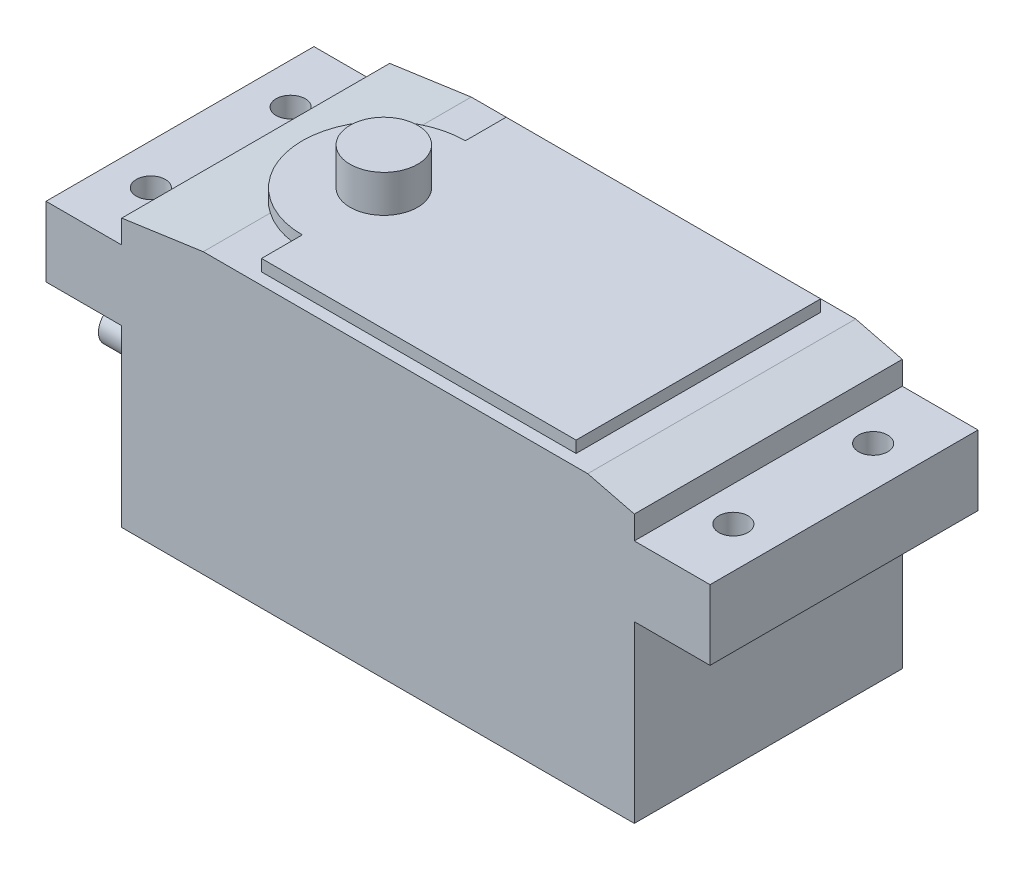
ISO-10303-21;
HEADER;
FILE_DESCRIPTION(('STEP AP214'),'2;1');
FILE_NAME('part.step','',(''),(''),'','','');
FILE_SCHEMA(('AUTOMOTIVE_DESIGN { 1 0 10303 214 1 1 1 1 }'));
ENDSEC;
DATA;
#1=APPLICATION_CONTEXT('core data for automotive mechanical design processes');
#2=APPLICATION_PROTOCOL_DEFINITION('international standard','automotive_design',2000,#1);
#3=PRODUCT_CONTEXT('',#1,'mechanical');
#4=PRODUCT('Part','Part','',(#3));
#5=PRODUCT_RELATED_PRODUCT_CATEGORY('part','',(#4));
#6=PRODUCT_DEFINITION_FORMATION('','',#4);
#7=PRODUCT_DEFINITION_CONTEXT('part definition',#1,'design');
#8=PRODUCT_DEFINITION('design','',#6,#7);
#9=PRODUCT_DEFINITION_SHAPE('','',#8);
#10=(LENGTH_UNIT() NAMED_UNIT(*) SI_UNIT(.MILLI.,.METRE.));
#11=(NAMED_UNIT(*) PLANE_ANGLE_UNIT() SI_UNIT($,.RADIAN.));
#12=(NAMED_UNIT(*) SI_UNIT($,.STERADIAN.) SOLID_ANGLE_UNIT());
#13=UNCERTAINTY_MEASURE_WITH_UNIT(LENGTH_MEASURE(1.E-05),#10,'distance_accuracy_value','');
#14=(GEOMETRIC_REPRESENTATION_CONTEXT(3) GLOBAL_UNCERTAINTY_ASSIGNED_CONTEXT((#13)) GLOBAL_UNIT_ASSIGNED_CONTEXT((#10,
#11,#12)) REPRESENTATION_CONTEXT('',''));
#15=CARTESIAN_POINT('',(0.,0.,0.));
#16=DIRECTION('',(0.,0.,1.));
#17=DIRECTION('',(1.,0.,0.));
#18=AXIS2_PLACEMENT_3D('',#15,#16,#17);
#19=CARTESIAN_POINT('',(11.,25.,11.5));
#20=DIRECTION('',(0.,1.,0.));
#21=DIRECTION('',(0.,0.,1.));
#22=AXIS2_PLACEMENT_3D('',#19,#20,#21);
#23=PLANE('',#22);
#24=DIRECTION('',(-1.,0.,0.));
#25=VECTOR('',#24,1.);
#26=CARTESIAN_POINT('',(38.,25.,1.));
#27=LINE('',#26,#25);
#28=CARTESIAN_POINT('',(38.,25.,1.));
#29=VERTEX_POINT('',#28);
#30=CARTESIAN_POINT('',(11.,25.,1.));
#31=VERTEX_POINT('',#30);
#32=EDGE_CURVE('E231',#29,#31,#27,.T.);
#33=ORIENTED_EDGE('',*,*,#32,.T.);
#34=DIRECTION('',(0.,0.,1.));
#35=VECTOR('',#34,1.);
#36=CARTESIAN_POINT('',(11.,25.,1.));
#37=LINE('',#36,#35);
#38=CARTESIAN_POINT('',(11.,25.,4.5));
#39=VERTEX_POINT('',#38);
#40=EDGE_CURVE('E240',#31,#39,#37,.T.);
#41=ORIENTED_EDGE('',*,*,#40,.T.);
#42=CARTESIAN_POINT('',(11.,25.,11.5));
#43=DIRECTION('',(0.,1.,0.));
#44=DIRECTION('',(0.,0.,1.));
#45=AXIS2_PLACEMENT_3D('',#42,#43,#44);
#46=CIRCLE('',#45,7.);
#47=CARTESIAN_POINT('',(11.,25.,18.5));
#48=VERTEX_POINT('',#47);
#49=EDGE_CURVE('E245',#39,#48,#46,.T.);
#50=ORIENTED_EDGE('',*,*,#49,.T.);
#51=DIRECTION('',(0.,0.,1.));
#52=VECTOR('',#51,1.);
#53=CARTESIAN_POINT('',(11.,25.,18.5));
#54=LINE('',#53,#52);
#55=CARTESIAN_POINT('',(11.,25.,22.));
#56=VERTEX_POINT('',#55);
#57=EDGE_CURVE('E259',#48,#56,#54,.T.);
#58=ORIENTED_EDGE('',*,*,#57,.T.);
#59=DIRECTION('',(1.,0.,0.));
#60=VECTOR('',#59,1.);
#61=CARTESIAN_POINT('',(38.,25.,22.));
#62=LINE('',#61,#60);
#63=CARTESIAN_POINT('',(38.,25.,22.));
#64=VERTEX_POINT('',#63);
#65=EDGE_CURVE('E262',#56,#64,#62,.T.);
#66=ORIENTED_EDGE('',*,*,#65,.T.);
#67=DIRECTION('',(0.,0.,-1.));
#68=VECTOR('',#67,1.);
#69=CARTESIAN_POINT('',(38.,25.,22.));
#70=LINE('',#69,#68);
#71=EDGE_CURVE('E237',#64,#29,#70,.T.);
#72=ORIENTED_EDGE('',*,*,#71,.T.);
#73=EDGE_LOOP('',(#33,#41,#50,#58,#66,#72));
#74=FACE_BOUND('',#73,.T.);
#75=CARTESIAN_POINT('',(11.,25.,11.5));
#76=DIRECTION('',(0.,1.,0.));
#77=DIRECTION('',(0.,0.,1.));
#78=AXIS2_PLACEMENT_3D('',#75,#76,#77);
#79=CIRCLE('',#78,2.9);
#80=CARTESIAN_POINT('',(11.,25.,14.4));
#81=VERTEX_POINT('',#80);
#82=EDGE_CURVE('E254',#81,#81,#79,.T.);
#83=ORIENTED_EDGE('',*,*,#82,.F.);
#84=EDGE_LOOP('',(#83));
#85=FACE_BOUND('',#84,.T.);
#86=ADVANCED_FACE('F34',(#74,#85),#23,.T.);
#87=CARTESIAN_POINT('',(-0.5,5.,10.));
#88=DIRECTION('',(-1.,0.,0.));
#89=DIRECTION('',(0.,0.,1.));
#90=AXIS2_PLACEMENT_3D('',#87,#88,#89);
#91=PLANE('',#90);
#92=CARTESIAN_POINT('',(-0.5,5.,10.));
#93=DIRECTION('',(-1.,0.,0.));
#94=DIRECTION('',(0.,0.,1.));
#95=AXIS2_PLACEMENT_3D('',#92,#93,#94);
#96=CIRCLE('',#95,2.);
#97=CARTESIAN_POINT('',(-0.5,7.,10.));
#98=VERTEX_POINT('',#97);
#99=CARTESIAN_POINT('',(-0.5,3.,10.));
#100=VERTEX_POINT('',#99);
#101=EDGE_CURVE('E325',#98,#100,#96,.T.);
#102=ORIENTED_EDGE('',*,*,#101,.T.);
#103=DIRECTION('',(0.,0.,1.));
#104=VECTOR('',#103,1.);
#105=CARTESIAN_POINT('',(-0.5,3.,13.));
#106=LINE('',#105,#104);
#107=CARTESIAN_POINT('',(-0.5,3.,13.));
#108=VERTEX_POINT('',#107);
#109=EDGE_CURVE('E328',#100,#108,#106,.T.);
#110=ORIENTED_EDGE('',*,*,#109,.T.);
#111=CARTESIAN_POINT('',(-0.5,5.,13.));
#112=DIRECTION('',(-1.,0.,0.));
#113=DIRECTION('',(0.,0.,-1.));
#114=AXIS2_PLACEMENT_3D('',#111,#112,#113);
#115=CIRCLE('',#114,2.);
#116=CARTESIAN_POINT('',(-0.5,7.,13.));
#117=VERTEX_POINT('',#116);
#118=EDGE_CURVE('E331',#108,#117,#115,.T.);
#119=ORIENTED_EDGE('',*,*,#118,.T.);
#120=DIRECTION('',(0.,0.,-1.));
#121=VECTOR('',#120,1.);
#122=CARTESIAN_POINT('',(-0.5,7.,10.));
#123=LINE('',#122,#121);
#124=EDGE_CURVE('E333',#117,#98,#123,.T.);
#125=ORIENTED_EDGE('',*,*,#124,.T.);
#126=EDGE_LOOP('',(#102,#110,#119,#125));
#127=FACE_BOUND('',#126,.T.);
#128=DIRECTION('',(0.,0.,1.));
#129=VECTOR('',#128,1.);
#130=CARTESIAN_POINT('',(-0.5,3.5,10.));
#131=LINE('',#130,#129);
#132=CARTESIAN_POINT('',(-0.5,3.5,10.));
#133=VERTEX_POINT('',#132);
#134=CARTESIAN_POINT('',(-0.5,3.5,13.));
#135=VERTEX_POINT('',#134);
#136=EDGE_CURVE('E309',#133,#135,#131,.T.);
#137=ORIENTED_EDGE('',*,*,#136,.F.);
#138=CARTESIAN_POINT('',(-0.5,5.,10.));
#139=DIRECTION('',(-1.,0.,0.));
#140=DIRECTION('',(0.,0.,1.));
#141=AXIS2_PLACEMENT_3D('',#138,#139,#140);
#142=CIRCLE('',#141,1.5);
#143=CARTESIAN_POINT('',(-0.5,6.5,10.));
#144=VERTEX_POINT('',#143);
#145=EDGE_CURVE('E294',#144,#133,#142,.T.);
#146=ORIENTED_EDGE('',*,*,#145,.F.);
#147=DIRECTION('',(0.,0.,-1.));
#148=VECTOR('',#147,1.);
#149=CARTESIAN_POINT('',(-0.5,6.5,13.));
#150=LINE('',#149,#148);
#151=CARTESIAN_POINT('',(-0.5,6.5,13.));
#152=VERTEX_POINT('',#151);
#153=EDGE_CURVE('E300',#152,#144,#150,.T.);
#154=ORIENTED_EDGE('',*,*,#153,.F.);
#155=CARTESIAN_POINT('',(-0.5,5.,13.));
#156=DIRECTION('',(-1.,0.,0.));
#157=DIRECTION('',(0.,0.,1.));
#158=AXIS2_PLACEMENT_3D('',#155,#156,#157);
#159=CIRCLE('',#158,1.5);
#160=EDGE_CURVE('E311',#135,#152,#159,.T.);
#161=ORIENTED_EDGE('',*,*,#160,.F.);
#162=EDGE_LOOP('',(#137,#146,#154,#161));
#163=FACE_BOUND('',#162,.T.);
#164=ADVANCED_FACE('F498',(#127,#163),#91,.T.);
#165=CARTESIAN_POINT('',(0.,0.,23.));
#166=DIRECTION('',(1.,0.,0.));
#167=DIRECTION('',(0.,0.,-1.));
#168=AXIS2_PLACEMENT_3D('',#165,#166,#167);
#169=PLANE('',#168);
#170=DIRECTION('',(0.,-1.,0.));
#171=VECTOR('',#170,1.);
#172=CARTESIAN_POINT('',(0.,0.,0.));
#173=LINE('',#172,#171);
#174=CARTESIAN_POINT('',(0.,15.,0.));
#175=VERTEX_POINT('',#174);
#176=CARTESIAN_POINT('',(0.,0.,0.));
#177=VERTEX_POINT('',#176);
#178=EDGE_CURVE('E406',#175,#177,#173,.T.);
#179=ORIENTED_EDGE('',*,*,#178,.T.);
#180=DIRECTION('',(0.,0.,-1.));
#181=VECTOR('',#180,1.);
#182=CARTESIAN_POINT('',(0.,0.,23.));
#183=LINE('',#182,#181);
#184=CARTESIAN_POINT('',(0.,0.,23.));
#185=VERTEX_POINT('',#184);
#186=EDGE_CURVE('E458',#185,#177,#183,.T.);
#187=ORIENTED_EDGE('',*,*,#186,.F.);
#188=DIRECTION('',(0.,-1.,0.));
#189=VECTOR('',#188,1.);
#190=CARTESIAN_POINT('',(0.,0.,23.));
#191=LINE('',#190,#189);
#192=CARTESIAN_POINT('',(0.,15.,23.));
#193=VERTEX_POINT('',#192);
#194=EDGE_CURVE('E377',#193,#185,#191,.T.);
#195=ORIENTED_EDGE('',*,*,#194,.F.);
#196=DIRECTION('',(0.,0.,-1.));
#197=VECTOR('',#196,1.);
#198=CARTESIAN_POINT('',(0.,15.,23.));
#199=LINE('',#198,#197);
#200=EDGE_CURVE('E405',#193,#175,#199,.T.);
#201=ORIENTED_EDGE('',*,*,#200,.T.);
#202=EDGE_LOOP('',(#179,#187,#195,#201));
#203=FACE_BOUND('',#202,.T.);
#204=CARTESIAN_POINT('',(0.,5.,10.));
#205=DIRECTION('',(-1.,0.,0.));
#206=DIRECTION('',(0.,0.,1.));
#207=AXIS2_PLACEMENT_3D('',#204,#205,#206);
#208=CIRCLE('',#207,2.);
#209=CARTESIAN_POINT('',(0.,7.,10.));
#210=VERTEX_POINT('',#209);
#211=CARTESIAN_POINT('',(0.,3.,10.));
#212=VERTEX_POINT('',#211);
#213=EDGE_CURVE('E324',#210,#212,#208,.T.);
#214=ORIENTED_EDGE('',*,*,#213,.F.);
#215=DIRECTION('',(0.,0.,-1.));
#216=VECTOR('',#215,1.);
#217=CARTESIAN_POINT('',(0.,7.,10.));
#218=LINE('',#217,#216);
#219=CARTESIAN_POINT('',(0.,7.,13.));
#220=VERTEX_POINT('',#219);
#221=EDGE_CURVE('E329',#220,#210,#218,.T.);
#222=ORIENTED_EDGE('',*,*,#221,.F.);
#223=CARTESIAN_POINT('',(0.,5.,13.));
#224=DIRECTION('',(-1.,0.,0.));
#225=DIRECTION('',(0.,0.,-1.));
#226=AXIS2_PLACEMENT_3D('',#223,#224,#225);
#227=CIRCLE('',#226,2.);
#228=CARTESIAN_POINT('',(0.,3.,13.));
#229=VERTEX_POINT('',#228);
#230=EDGE_CURVE('E341',#229,#220,#227,.T.);
#231=ORIENTED_EDGE('',*,*,#230,.F.);
#232=DIRECTION('',(0.,0.,1.));
#233=VECTOR('',#232,1.);
#234=CARTESIAN_POINT('',(0.,3.,13.));
#235=LINE('',#234,#233);
#236=EDGE_CURVE('E338',#212,#229,#235,.T.);
#237=ORIENTED_EDGE('',*,*,#236,.F.);
#238=EDGE_LOOP('',(#214,#222,#231,#237));
#239=FACE_BOUND('',#238,.T.);
#240=ADVANCED_FACE('F36',(#203,#239),#169,.F.);
#241=CARTESIAN_POINT('',(0.,0.,23.));
#242=DIRECTION('',(0.,1.,0.));
#243=DIRECTION('',(0.,0.,1.));
#244=AXIS2_PLACEMENT_3D('',#241,#242,#243);
#245=PLANE('',#244);
#246=DIRECTION('',(1.,0.,0.));
#247=VECTOR('',#246,1.);
#248=CARTESIAN_POINT('',(0.,0.,0.));
#249=LINE('',#248,#247);
#250=CARTESIAN_POINT('',(44.,0.,0.));
#251=VERTEX_POINT('',#250);
#252=EDGE_CURVE('E409',#177,#251,#249,.T.);
#253=ORIENTED_EDGE('',*,*,#252,.T.);
#254=DIRECTION('',(0.,0.,-1.));
#255=VECTOR('',#254,1.);
#256=CARTESIAN_POINT('',(44.,0.,23.));
#257=LINE('',#256,#255);
#258=CARTESIAN_POINT('',(44.,0.,23.));
#259=VERTEX_POINT('',#258);
#260=EDGE_CURVE('E455',#259,#251,#257,.T.);
#261=ORIENTED_EDGE('',*,*,#260,.F.);
#262=DIRECTION('',(1.,0.,0.));
#263=VECTOR('',#262,1.);
#264=CARTESIAN_POINT('',(0.,0.,23.));
#265=LINE('',#264,#263);
#266=EDGE_CURVE('E380',#185,#259,#265,.T.);
#267=ORIENTED_EDGE('',*,*,#266,.F.);
#268=ORIENTED_EDGE('',*,*,#186,.T.);
#269=EDGE_LOOP('',(#253,#261,#267,#268));
#270=FACE_BOUND('',#269,.T.);
#271=ADVANCED_FACE('F620',(#270),#245,.F.);
#272=CARTESIAN_POINT('',(44.,0.,23.));
#273=DIRECTION('',(-1.,0.,0.));
#274=DIRECTION('',(0.,0.,1.));
#275=AXIS2_PLACEMENT_3D('',#272,#273,#274);
#276=PLANE('',#275);
#277=DIRECTION('',(0.,1.,0.));
#278=VECTOR('',#277,1.);
#279=CARTESIAN_POINT('',(44.,0.,0.));
#280=LINE('',#279,#278);
#281=CARTESIAN_POINT('',(44.,15.,0.));
#282=VERTEX_POINT('',#281);
#283=EDGE_CURVE('E411',#251,#282,#280,.T.);
#284=ORIENTED_EDGE('',*,*,#283,.T.);
#285=DIRECTION('',(0.,0.,-1.));
#286=VECTOR('',#285,1.);
#287=CARTESIAN_POINT('',(44.,15.,23.));
#288=LINE('',#287,#286);
#289=CARTESIAN_POINT('',(44.,15.,23.));
#290=VERTEX_POINT('',#289);
#291=EDGE_CURVE('E452',#290,#282,#288,.T.);
#292=ORIENTED_EDGE('',*,*,#291,.F.);
#293=DIRECTION('',(0.,1.,0.));
#294=VECTOR('',#293,1.);
#295=CARTESIAN_POINT('',(44.,0.,23.));
#296=LINE('',#295,#294);
#297=EDGE_CURVE('E383',#259,#290,#296,.T.);
#298=ORIENTED_EDGE('',*,*,#297,.F.);
#299=ORIENTED_EDGE('',*,*,#260,.T.);
#300=EDGE_LOOP('',(#284,#292,#298,#299));
#301=FACE_BOUND('',#300,.T.);
#302=ADVANCED_FACE('F617',(#301),#276,.F.);
#303=CARTESIAN_POINT('',(44.,15.,23.));
#304=DIRECTION('',(0.,1.,0.));
#305=DIRECTION('',(0.,0.,1.));
#306=AXIS2_PLACEMENT_3D('',#303,#304,#305);
#307=PLANE('',#306);
#308=CARTESIAN_POINT('',(47.,15.,5.5));
#309=DIRECTION('',(0.,1.,0.));
#310=DIRECTION('',(0.,0.,1.));
#311=AXIS2_PLACEMENT_3D('',#308,#309,#310);
#312=CIRCLE('',#311,1.25);
#313=CARTESIAN_POINT('',(47.,15.,6.75));
#314=VERTEX_POINT('',#313);
#315=EDGE_CURVE('E360',#314,#314,#312,.T.);
#316=ORIENTED_EDGE('',*,*,#315,.T.);
#317=EDGE_LOOP('',(#316));
#318=FACE_BOUND('',#317,.T.);
#319=CARTESIAN_POINT('',(47.,15.,17.5));
#320=DIRECTION('',(0.,1.,0.));
#321=DIRECTION('',(0.,0.,1.));
#322=AXIS2_PLACEMENT_3D('',#319,#320,#321);
#323=CIRCLE('',#322,1.25);
#324=CARTESIAN_POINT('',(47.,15.,18.75));
#325=VERTEX_POINT('',#324);
#326=EDGE_CURVE('E366',#325,#325,#323,.T.);
#327=ORIENTED_EDGE('',*,*,#326,.T.);
#328=EDGE_LOOP('',(#327));
#329=FACE_BOUND('',#328,.T.);
#330=DIRECTION('',(1.,0.,0.));
#331=VECTOR('',#330,1.);
#332=CARTESIAN_POINT('',(44.,15.,0.));
#333=LINE('',#332,#331);
#334=CARTESIAN_POINT('',(50.5,15.,0.));
#335=VERTEX_POINT('',#334);
#336=EDGE_CURVE('E413',#282,#335,#333,.T.);
#337=ORIENTED_EDGE('',*,*,#336,.T.);
#338=DIRECTION('',(0.,0.,-1.));
#339=VECTOR('',#338,1.);
#340=CARTESIAN_POINT('',(50.5,15.,23.));
#341=LINE('',#340,#339);
#342=CARTESIAN_POINT('',(50.5,15.,23.));
#343=VERTEX_POINT('',#342);
#344=EDGE_CURVE('E449',#343,#335,#341,.T.);
#345=ORIENTED_EDGE('',*,*,#344,.F.);
#346=DIRECTION('',(1.,0.,0.));
#347=VECTOR('',#346,1.);
#348=CARTESIAN_POINT('',(44.,15.,23.));
#349=LINE('',#348,#347);
#350=EDGE_CURVE('E385',#290,#343,#349,.T.);
#351=ORIENTED_EDGE('',*,*,#350,.F.);
#352=ORIENTED_EDGE('',*,*,#291,.T.);
#353=EDGE_LOOP('',(#337,#345,#351,#352));
#354=FACE_BOUND('',#353,.T.);
#355=ADVANCED_FACE('F613',(#318,#329,#354),#307,.F.);
#356=CARTESIAN_POINT('',(50.5,15.,23.));
#357=DIRECTION('',(-1.,0.,0.));
#358=DIRECTION('',(0.,0.,1.));
#359=AXIS2_PLACEMENT_3D('',#356,#357,#358);
#360=PLANE('',#359);
#361=DIRECTION('',(0.,1.,0.));
#362=VECTOR('',#361,1.);
#363=CARTESIAN_POINT('',(50.5,15.,0.));
#364=LINE('',#363,#362);
#365=CARTESIAN_POINT('',(50.5,21.,0.));
#366=VERTEX_POINT('',#365);
#367=EDGE_CURVE('E415',#335,#366,#364,.T.);
#368=ORIENTED_EDGE('',*,*,#367,.T.);
#369=DIRECTION('',(0.,0.,-1.));
#370=VECTOR('',#369,1.);
#371=CARTESIAN_POINT('',(50.5,21.,23.));
#372=LINE('',#371,#370);
#373=CARTESIAN_POINT('',(50.5,21.,23.));
#374=VERTEX_POINT('',#373);
#375=EDGE_CURVE('E446',#374,#366,#372,.T.);
#376=ORIENTED_EDGE('',*,*,#375,.F.);
#377=DIRECTION('',(0.,1.,0.));
#378=VECTOR('',#377,1.);
#379=CARTESIAN_POINT('',(50.5,15.,23.));
#380=LINE('',#379,#378);
#381=EDGE_CURVE('E387',#343,#374,#380,.T.);
#382=ORIENTED_EDGE('',*,*,#381,.F.);
#383=ORIENTED_EDGE('',*,*,#344,.T.);
#384=EDGE_LOOP('',(#368,#376,#382,#383));
#385=FACE_BOUND('',#384,.T.);
#386=ADVANCED_FACE('F609',(#385),#360,.F.);
#387=CARTESIAN_POINT('',(50.5,21.,23.));
#388=DIRECTION('',(0.,-1.,0.));
#389=DIRECTION('',(0.,0.,-1.));
#390=AXIS2_PLACEMENT_3D('',#387,#388,#389);
#391=PLANE('',#390);
#392=CARTESIAN_POINT('',(47.,21.,5.5));
#393=DIRECTION('',(0.,1.,0.));
#394=DIRECTION('',(0.,0.,1.));
#395=AXIS2_PLACEMENT_3D('',#392,#393,#394);
#396=CIRCLE('',#395,1.25);
#397=CARTESIAN_POINT('',(47.,21.,6.75));
#398=VERTEX_POINT('',#397);
#399=EDGE_CURVE('E357',#398,#398,#396,.T.);
#400=ORIENTED_EDGE('',*,*,#399,.F.);
#401=EDGE_LOOP('',(#400));
#402=FACE_BOUND('',#401,.T.);
#403=CARTESIAN_POINT('',(47.,21.,17.5));
#404=DIRECTION('',(0.,1.,0.));
#405=DIRECTION('',(0.,0.,1.));
#406=AXIS2_PLACEMENT_3D('',#403,#404,#405);
#407=CIRCLE('',#406,1.25);
#408=CARTESIAN_POINT('',(47.,21.,18.75));
#409=VERTEX_POINT('',#408);
#410=EDGE_CURVE('E363',#409,#409,#407,.T.);
#411=ORIENTED_EDGE('',*,*,#410,.F.);
#412=EDGE_LOOP('',(#411));
#413=FACE_BOUND('',#412,.T.);
#414=DIRECTION('',(-1.,0.,0.));
#415=VECTOR('',#414,1.);
#416=CARTESIAN_POINT('',(50.5,21.,0.));
#417=LINE('',#416,#415);
#418=CARTESIAN_POINT('',(44.,21.,0.));
#419=VERTEX_POINT('',#418);
#420=EDGE_CURVE('E417',#366,#419,#417,.T.);
#421=ORIENTED_EDGE('',*,*,#420,.T.);
#422=DIRECTION('',(0.,0.,-1.));
#423=VECTOR('',#422,1.);
#424=CARTESIAN_POINT('',(44.,21.,23.));
#425=LINE('',#424,#423);
#426=CARTESIAN_POINT('',(44.,21.,23.));
#427=VERTEX_POINT('',#426);
#428=EDGE_CURVE('E443',#427,#419,#425,.T.);
#429=ORIENTED_EDGE('',*,*,#428,.F.);
#430=DIRECTION('',(-1.,0.,0.));
#431=VECTOR('',#430,1.);
#432=CARTESIAN_POINT('',(50.5,21.,23.));
#433=LINE('',#432,#431);
#434=EDGE_CURVE('E389',#374,#427,#433,.T.);
#435=ORIENTED_EDGE('',*,*,#434,.F.);
#436=ORIENTED_EDGE('',*,*,#375,.T.);
#437=EDGE_LOOP('',(#421,#429,#435,#436));
#438=FACE_BOUND('',#437,.T.);
#439=ADVANCED_FACE('F605',(#402,#413,#438),#391,.F.);
#440=CARTESIAN_POINT('',(44.,21.,23.));
#441=DIRECTION('',(-1.,0.,0.));
#442=DIRECTION('',(0.,0.,1.));
#443=AXIS2_PLACEMENT_3D('',#440,#441,#442);
#444=PLANE('',#443);
#445=DIRECTION('',(0.,1.,0.));
#446=VECTOR('',#445,1.);
#447=CARTESIAN_POINT('',(44.,21.,0.));
#448=LINE('',#447,#446);
#449=CARTESIAN_POINT('',(44.,23.,0.));
#450=VERTEX_POINT('',#449);
#451=EDGE_CURVE('E419',#419,#450,#448,.T.);
#452=ORIENTED_EDGE('',*,*,#451,.T.);
#453=DIRECTION('',(0.,0.,1.));
#454=VECTOR('',#453,1.);
#455=CARTESIAN_POINT('',(44.,23.,0.));
#456=LINE('',#455,#454);
#457=CARTESIAN_POINT('',(44.,23.,23.));
#458=VERTEX_POINT('',#457);
#459=EDGE_CURVE('E291',#450,#458,#456,.T.);
#460=ORIENTED_EDGE('',*,*,#459,.T.);
#461=DIRECTION('',(0.,1.,0.));
#462=VECTOR('',#461,1.);
#463=CARTESIAN_POINT('',(44.,21.,23.));
#464=LINE('',#463,#462);
#465=EDGE_CURVE('E391',#427,#458,#464,.T.);
#466=ORIENTED_EDGE('',*,*,#465,.F.);
#467=ORIENTED_EDGE('',*,*,#428,.T.);
#468=EDGE_LOOP('',(#452,#460,#466,#467));
#469=FACE_BOUND('',#468,.T.);
#470=ADVANCED_FACE('F602',(#469),#444,.F.);
#471=CARTESIAN_POINT('',(0.,24.,23.));
#472=DIRECTION('',(0.,-1.,0.));
#473=DIRECTION('',(0.,0.,-1.));
#474=AXIS2_PLACEMENT_3D('',#471,#472,#473);
#475=PLANE('',#474);
#476=DIRECTION('',(0.,0.,-1.));
#477=VECTOR('',#476,1.);
#478=CARTESIAN_POINT('',(11.,24.,23.));
#479=LINE('',#478,#477);
#480=CARTESIAN_POINT('',(11.,24.,22.));
#481=VERTEX_POINT('',#480);
#482=CARTESIAN_POINT('',(11.,24.,18.5));
#483=VERTEX_POINT('',#482);
#484=EDGE_CURVE('E11',#481,#483,#479,.T.);
#485=ORIENTED_EDGE('',*,*,#484,.T.);
#486=CARTESIAN_POINT('',(11.,24.,11.5));
#487=DIRECTION('',(0.,-1.,0.));
#488=DIRECTION('',(0.,0.,-1.));
#489=AXIS2_PLACEMENT_3D('',#486,#487,#488);
#490=CIRCLE('',#489,7.);
#491=CARTESIAN_POINT('',(7.,24.,17.244562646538));
#492=VERTEX_POINT('',#491);
#493=EDGE_CURVE('E275',#483,#492,#490,.T.);
#494=ORIENTED_EDGE('',*,*,#493,.T.);
#495=DIRECTION('',(0.,0.,1.));
#496=VECTOR('',#495,1.);
#497=CARTESIAN_POINT('',(7.,24.,0.));
#498=LINE('',#497,#496);
#499=CARTESIAN_POINT('',(7.,24.,23.));
#500=VERTEX_POINT('',#499);
#501=EDGE_CURVE('E284',#492,#500,#498,.T.);
#502=ORIENTED_EDGE('',*,*,#501,.T.);
#503=DIRECTION('',(-1.,0.,0.));
#504=VECTOR('',#503,1.);
#505=CARTESIAN_POINT('',(0.,24.,23.));
#506=LINE('',#505,#504);
#507=CARTESIAN_POINT('',(40.,24.,23.));
#508=VERTEX_POINT('',#507);
#509=EDGE_CURVE('E394',#508,#500,#506,.T.);
#510=ORIENTED_EDGE('',*,*,#509,.F.);
#511=DIRECTION('',(0.,0.,1.));
#512=VECTOR('',#511,1.);
#513=CARTESIAN_POINT('',(40.,24.,0.));
#514=LINE('',#513,#512);
#515=CARTESIAN_POINT('',(40.,24.,0.));
#516=VERTEX_POINT('',#515);
#517=EDGE_CURVE('E289',#516,#508,#514,.T.);
#518=ORIENTED_EDGE('',*,*,#517,.F.);
#519=DIRECTION('',(-1.,0.,0.));
#520=VECTOR('',#519,1.);
#521=CARTESIAN_POINT('',(0.,24.,0.));
#522=LINE('',#521,#520);
#523=CARTESIAN_POINT('',(7.,24.,0.));
#524=VERTEX_POINT('',#523);
#525=EDGE_CURVE('E422',#516,#524,#522,.T.);
#526=ORIENTED_EDGE('',*,*,#525,.T.);
#527=CARTESIAN_POINT('',(7.,24.,5.75543735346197));
#528=VERTEX_POINT('',#527);
#529=EDGE_CURVE('E56',#524,#528,#498,.T.);
#530=ORIENTED_EDGE('',*,*,#529,.T.);
#531=CARTESIAN_POINT('',(11.,24.,4.5));
#532=VERTEX_POINT('',#531);
#533=EDGE_CURVE('E49',#528,#532,#490,.T.);
#534=ORIENTED_EDGE('',*,*,#533,.T.);
#535=DIRECTION('',(0.,0.,-1.));
#536=VECTOR('',#535,1.);
#537=CARTESIAN_POINT('',(11.,24.,23.));
#538=LINE('',#537,#536);
#539=CARTESIAN_POINT('',(11.,24.,1.));
#540=VERTEX_POINT('',#539);
#541=EDGE_CURVE('E467',#532,#540,#538,.T.);
#542=ORIENTED_EDGE('',*,*,#541,.T.);
#543=DIRECTION('',(1.,0.,0.));
#544=VECTOR('',#543,1.);
#545=CARTESIAN_POINT('',(0.,24.,1.));
#546=LINE('',#545,#544);
#547=CARTESIAN_POINT('',(38.,24.,1.));
#548=VERTEX_POINT('',#547);
#549=EDGE_CURVE('E233',#540,#548,#546,.T.);
#550=ORIENTED_EDGE('',*,*,#549,.T.);
#551=DIRECTION('',(0.,0.,1.));
#552=VECTOR('',#551,1.);
#553=CARTESIAN_POINT('',(38.,24.,23.));
#554=LINE('',#553,#552);
#555=CARTESIAN_POINT('',(38.,24.,22.));
#556=VERTEX_POINT('',#555);
#557=EDGE_CURVE('E470',#548,#556,#554,.T.);
#558=ORIENTED_EDGE('',*,*,#557,.T.);
#559=DIRECTION('',(-1.,0.,0.));
#560=VECTOR('',#559,1.);
#561=CARTESIAN_POINT('',(0.,24.,22.));
#562=LINE('',#561,#560);
#563=EDGE_CURVE('E42',#556,#481,#562,.T.);
#564=ORIENTED_EDGE('',*,*,#563,.T.);
#565=EDGE_LOOP('',(#485,#494,#502,#510,#518,#526,#530,#534,#542,#550,#558,#564));
#566=FACE_BOUND('',#565,.T.);
#567=ADVANCED_FACE('F474',(#566),#475,.F.);
#568=CARTESIAN_POINT('',(0.,21.,23.));
#569=DIRECTION('',(1.,0.,0.));
#570=DIRECTION('',(0.,1.,0.));
#571=AXIS2_PLACEMENT_3D('',#568,#569,#570);
#572=PLANE('',#571);
#573=DIRECTION('',(0.,-1.,0.));
#574=VECTOR('',#573,1.);
#575=CARTESIAN_POINT('',(0.,21.,23.));
#576=LINE('',#575,#574);
#577=CARTESIAN_POINT('',(0.,23.,23.));
#578=VERTEX_POINT('',#577);
#579=CARTESIAN_POINT('',(0.,21.,23.));
#580=VERTEX_POINT('',#579);
#581=EDGE_CURVE('E397',#578,#580,#576,.T.);
#582=ORIENTED_EDGE('',*,*,#581,.F.);
#583=DIRECTION('',(0.,0.,1.));
#584=VECTOR('',#583,1.);
#585=CARTESIAN_POINT('',(0.,23.,0.));
#586=LINE('',#585,#584);
#587=CARTESIAN_POINT('',(0.,23.,0.));
#588=VERTEX_POINT('',#587);
#589=EDGE_CURVE('E278',#588,#578,#586,.T.);
#590=ORIENTED_EDGE('',*,*,#589,.F.);
#591=DIRECTION('',(0.,-1.,0.));
#592=VECTOR('',#591,1.);
#593=CARTESIAN_POINT('',(0.,21.,0.));
#594=LINE('',#593,#592);
#595=CARTESIAN_POINT('',(0.,21.,0.));
#596=VERTEX_POINT('',#595);
#597=EDGE_CURVE('E425',#588,#596,#594,.T.);
#598=ORIENTED_EDGE('',*,*,#597,.T.);
#599=DIRECTION('',(0.,0.,-1.));
#600=VECTOR('',#599,1.);
#601=CARTESIAN_POINT('',(0.,21.,23.));
#602=LINE('',#601,#600);
#603=EDGE_CURVE('E440',#580,#596,#602,.T.);
#604=ORIENTED_EDGE('',*,*,#603,.F.);
#605=EDGE_LOOP('',(#582,#590,#598,#604));
#606=FACE_BOUND('',#605,.T.);
#607=ADVANCED_FACE('F595',(#606),#572,.F.);
#608=CARTESIAN_POINT('',(0.,21.,23.));
#609=DIRECTION('',(0.,-1.,0.));
#610=DIRECTION('',(0.,0.,-1.));
#611=AXIS2_PLACEMENT_3D('',#608,#609,#610);
#612=PLANE('',#611);
#613=CARTESIAN_POINT('',(-3.,21.,17.5));
#614=DIRECTION('',(0.,1.,0.));
#615=DIRECTION('',(0.,0.,1.));
#616=AXIS2_PLACEMENT_3D('',#613,#614,#615);
#617=CIRCLE('',#616,1.25);
#618=CARTESIAN_POINT('',(-3.,21.,18.75));
#619=VERTEX_POINT('',#618);
#620=EDGE_CURVE('E369',#619,#619,#617,.T.);
#621=ORIENTED_EDGE('',*,*,#620,.F.);
#622=EDGE_LOOP('',(#621));
#623=FACE_BOUND('',#622,.T.);
#624=CARTESIAN_POINT('',(-3.,21.,5.5));
#625=DIRECTION('',(0.,1.,0.));
#626=DIRECTION('',(0.,0.,1.));
#627=AXIS2_PLACEMENT_3D('',#624,#625,#626);
#628=CIRCLE('',#627,1.25);
#629=CARTESIAN_POINT('',(-3.,21.,6.75));
#630=VERTEX_POINT('',#629);
#631=EDGE_CURVE('E373',#630,#630,#628,.T.);
#632=ORIENTED_EDGE('',*,*,#631,.F.);
#633=EDGE_LOOP('',(#632));
#634=FACE_BOUND('',#633,.T.);
#635=DIRECTION('',(-1.,0.,0.));
#636=VECTOR('',#635,1.);
#637=CARTESIAN_POINT('',(0.,21.,0.));
#638=LINE('',#637,#636);
#639=CARTESIAN_POINT('',(-6.5,21.,0.));
#640=VERTEX_POINT('',#639);
#641=EDGE_CURVE('E427',#596,#640,#638,.T.);
#642=ORIENTED_EDGE('',*,*,#641,.T.);
#643=DIRECTION('',(0.,0.,-1.));
#644=VECTOR('',#643,1.);
#645=CARTESIAN_POINT('',(-6.5,21.,23.));
#646=LINE('',#645,#644);
#647=CARTESIAN_POINT('',(-6.5,21.,23.));
#648=VERTEX_POINT('',#647);
#649=EDGE_CURVE('E437',#648,#640,#646,.T.);
#650=ORIENTED_EDGE('',*,*,#649,.F.);
#651=DIRECTION('',(-1.,0.,0.));
#652=VECTOR('',#651,1.);
#653=CARTESIAN_POINT('',(0.,21.,23.));
#654=LINE('',#653,#652);
#655=EDGE_CURVE('E399',#580,#648,#654,.T.);
#656=ORIENTED_EDGE('',*,*,#655,.F.);
#657=ORIENTED_EDGE('',*,*,#603,.T.);
#658=EDGE_LOOP('',(#642,#650,#656,#657));
#659=FACE_BOUND('',#658,.T.);
#660=ADVANCED_FACE('F591',(#623,#634,#659),#612,.F.);
#661=CARTESIAN_POINT('',(-6.5,15.,23.));
#662=DIRECTION('',(1.,0.,0.));
#663=DIRECTION('',(0.,0.,-1.));
#664=AXIS2_PLACEMENT_3D('',#661,#662,#663);
#665=PLANE('',#664);
#666=DIRECTION('',(0.,-1.,0.));
#667=VECTOR('',#666,1.);
#668=CARTESIAN_POINT('',(-6.5,15.,0.));
#669=LINE('',#668,#667);
#670=CARTESIAN_POINT('',(-6.5,15.,0.));
#671=VERTEX_POINT('',#670);
#672=EDGE_CURVE('E429',#640,#671,#669,.T.);
#673=ORIENTED_EDGE('',*,*,#672,.T.);
#674=DIRECTION('',(0.,0.,-1.));
#675=VECTOR('',#674,1.);
#676=CARTESIAN_POINT('',(-6.5,15.,23.));
#677=LINE('',#676,#675);
#678=CARTESIAN_POINT('',(-6.5,15.,23.));
#679=VERTEX_POINT('',#678);
#680=EDGE_CURVE('E434',#679,#671,#677,.T.);
#681=ORIENTED_EDGE('',*,*,#680,.F.);
#682=DIRECTION('',(0.,-1.,0.));
#683=VECTOR('',#682,1.);
#684=CARTESIAN_POINT('',(-6.5,15.,23.));
#685=LINE('',#684,#683);
#686=EDGE_CURVE('E401',#648,#679,#685,.T.);
#687=ORIENTED_EDGE('',*,*,#686,.F.);
#688=ORIENTED_EDGE('',*,*,#649,.T.);
#689=EDGE_LOOP('',(#673,#681,#687,#688));
#690=FACE_BOUND('',#689,.T.);
#691=ADVANCED_FACE('F587',(#690),#665,.F.);
#692=CARTESIAN_POINT('',(-6.5,15.,23.));
#693=DIRECTION('',(0.,1.,0.));
#694=DIRECTION('',(0.,0.,1.));
#695=AXIS2_PLACEMENT_3D('',#692,#693,#694);
#696=PLANE('',#695);
#697=CARTESIAN_POINT('',(-3.,15.,17.5));
#698=DIRECTION('',(0.,1.,0.));
#699=DIRECTION('',(0.,0.,1.));
#700=AXIS2_PLACEMENT_3D('',#697,#698,#699);
#701=CIRCLE('',#700,1.25);
#702=CARTESIAN_POINT('',(-3.,15.,18.75));
#703=VERTEX_POINT('',#702);
#704=EDGE_CURVE('E372',#703,#703,#701,.T.);
#705=ORIENTED_EDGE('',*,*,#704,.T.);
#706=EDGE_LOOP('',(#705));
#707=FACE_BOUND('',#706,.T.);
#708=CARTESIAN_POINT('',(-3.,15.,5.5));
#709=DIRECTION('',(0.,1.,0.));
#710=DIRECTION('',(0.,0.,1.));
#711=AXIS2_PLACEMENT_3D('',#708,#709,#710);
#712=CIRCLE('',#711,1.25);
#713=CARTESIAN_POINT('',(-3.,15.,6.75));
#714=VERTEX_POINT('',#713);
#715=EDGE_CURVE('E376',#714,#714,#712,.T.);
#716=ORIENTED_EDGE('',*,*,#715,.T.);
#717=EDGE_LOOP('',(#716));
#718=FACE_BOUND('',#717,.T.);
#719=DIRECTION('',(1.,0.,0.));
#720=VECTOR('',#719,1.);
#721=CARTESIAN_POINT('',(-6.5,15.,0.));
#722=LINE('',#721,#720);
#723=EDGE_CURVE('E381',#671,#175,#722,.T.);
#724=ORIENTED_EDGE('',*,*,#723,.T.);
#725=ORIENTED_EDGE('',*,*,#200,.F.);
#726=DIRECTION('',(1.,0.,0.));
#727=VECTOR('',#726,1.);
#728=CARTESIAN_POINT('',(-6.5,15.,23.));
#729=LINE('',#728,#727);
#730=EDGE_CURVE('E403',#679,#193,#729,.T.);
#731=ORIENTED_EDGE('',*,*,#730,.F.);
#732=ORIENTED_EDGE('',*,*,#680,.T.);
#733=EDGE_LOOP('',(#724,#725,#731,#732));
#734=FACE_BOUND('',#733,.T.);
#735=ADVANCED_FACE('F580',(#707,#718,#734),#696,.F.);
#736=CARTESIAN_POINT('',(0.,15.,23.));
#737=DIRECTION('',(0.,0.,-1.));
#738=DIRECTION('',(-1.,0.,0.));
#739=AXIS2_PLACEMENT_3D('',#736,#737,#738);
#740=PLANE('',#739);
#741=ORIENTED_EDGE('',*,*,#509,.T.);
#742=DIRECTION('',(0.989949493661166,0.14142135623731,0.));
#743=VECTOR('',#742,1.);
#744=CARTESIAN_POINT('',(0.,23.,23.));
#745=LINE('',#744,#743);
#746=EDGE_CURVE('E279',#578,#500,#745,.T.);
#747=ORIENTED_EDGE('',*,*,#746,.F.);
#748=ORIENTED_EDGE('',*,*,#581,.T.);
#749=ORIENTED_EDGE('',*,*,#655,.T.);
#750=ORIENTED_EDGE('',*,*,#686,.T.);
#751=ORIENTED_EDGE('',*,*,#730,.T.);
#752=ORIENTED_EDGE('',*,*,#194,.T.);
#753=ORIENTED_EDGE('',*,*,#266,.T.);
#754=ORIENTED_EDGE('',*,*,#297,.T.);
#755=ORIENTED_EDGE('',*,*,#350,.T.);
#756=ORIENTED_EDGE('',*,*,#381,.T.);
#757=ORIENTED_EDGE('',*,*,#434,.T.);
#758=ORIENTED_EDGE('',*,*,#465,.T.);
#759=DIRECTION('',(0.970142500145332,-0.242535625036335,0.));
#760=VECTOR('',#759,1.);
#761=CARTESIAN_POINT('',(40.,24.,23.));
#762=LINE('',#761,#760);
#763=EDGE_CURVE('E283',#508,#458,#762,.T.);
#764=ORIENTED_EDGE('',*,*,#763,.F.);
#765=EDGE_LOOP('',(#741,#747,#748,#749,#750,#751,#752,#753,#754,#755,#756,#757,#758,#764));
#766=FACE_BOUND('',#765,.T.);
#767=ADVANCED_FACE('F577',(#766),#740,.F.);
#768=CARTESIAN_POINT('',(0.,15.,0.));
#769=DIRECTION('',(0.,0.,-1.));
#770=DIRECTION('',(-1.,0.,0.));
#771=AXIS2_PLACEMENT_3D('',#768,#769,#770);
#772=PLANE('',#771);
#773=DIRECTION('',(0.989949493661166,0.14142135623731,0.));
#774=VECTOR('',#773,1.);
#775=CARTESIAN_POINT('',(0.,23.,0.));
#776=LINE('',#775,#774);
#777=EDGE_CURVE('E276',#588,#524,#776,.T.);
#778=ORIENTED_EDGE('',*,*,#777,.T.);
#779=ORIENTED_EDGE('',*,*,#525,.F.);
#780=DIRECTION('',(0.970142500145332,-0.242535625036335,0.));
#781=VECTOR('',#780,1.);
#782=CARTESIAN_POINT('',(40.,24.,0.));
#783=LINE('',#782,#781);
#784=EDGE_CURVE('E286',#516,#450,#783,.T.);
#785=ORIENTED_EDGE('',*,*,#784,.T.);
#786=ORIENTED_EDGE('',*,*,#451,.F.);
#787=ORIENTED_EDGE('',*,*,#420,.F.);
#788=ORIENTED_EDGE('',*,*,#367,.F.);
#789=ORIENTED_EDGE('',*,*,#336,.F.);
#790=ORIENTED_EDGE('',*,*,#283,.F.);
#791=ORIENTED_EDGE('',*,*,#252,.F.);
#792=ORIENTED_EDGE('',*,*,#178,.F.);
#793=ORIENTED_EDGE('',*,*,#723,.F.);
#794=ORIENTED_EDGE('',*,*,#672,.F.);
#795=ORIENTED_EDGE('',*,*,#641,.F.);
#796=ORIENTED_EDGE('',*,*,#597,.F.);
#797=EDGE_LOOP('',(#778,#779,#785,#786,#787,#788,#789,#790,#791,#792,#793,#794,#795,#796));
#798=FACE_BOUND('',#797,.T.);
#799=ADVANCED_FACE('F575',(#798),#772,.T.);
#800=CARTESIAN_POINT('',(-3.,0.,5.5));
#801=DIRECTION('',(0.,1.,0.));
#802=DIRECTION('',(0.,0.,1.));
#803=AXIS2_PLACEMENT_3D('',#800,#801,#802);
#804=CYLINDRICAL_SURFACE('',#803,1.25);
#805=ORIENTED_EDGE('',*,*,#631,.T.);
#806=EDGE_LOOP('',(#805));
#807=FACE_BOUND('',#806,.T.);
#808=ORIENTED_EDGE('',*,*,#715,.F.);
#809=EDGE_LOOP('',(#808));
#810=FACE_BOUND('',#809,.T.);
#811=ADVANCED_FACE('F571',(#807,#810),#804,.F.);
#812=CARTESIAN_POINT('',(-3.,0.,17.5));
#813=DIRECTION('',(0.,1.,0.));
#814=DIRECTION('',(0.,0.,1.));
#815=AXIS2_PLACEMENT_3D('',#812,#813,#814);
#816=CYLINDRICAL_SURFACE('',#815,1.25);
#817=ORIENTED_EDGE('',*,*,#620,.T.);
#818=EDGE_LOOP('',(#817));
#819=FACE_BOUND('',#818,.T.);
#820=ORIENTED_EDGE('',*,*,#704,.F.);
#821=EDGE_LOOP('',(#820));
#822=FACE_BOUND('',#821,.T.);
#823=ADVANCED_FACE('F567',(#819,#822),#816,.F.);
#824=CARTESIAN_POINT('',(47.,0.,17.5));
#825=DIRECTION('',(0.,1.,0.));
#826=DIRECTION('',(0.,0.,1.));
#827=AXIS2_PLACEMENT_3D('',#824,#825,#826);
#828=CYLINDRICAL_SURFACE('',#827,1.25);
#829=ORIENTED_EDGE('',*,*,#410,.T.);
#830=EDGE_LOOP('',(#829));
#831=FACE_BOUND('',#830,.T.);
#832=ORIENTED_EDGE('',*,*,#326,.F.);
#833=EDGE_LOOP('',(#832));
#834=FACE_BOUND('',#833,.T.);
#835=ADVANCED_FACE('F563',(#831,#834),#828,.F.);
#836=CARTESIAN_POINT('',(47.,0.,5.5));
#837=DIRECTION('',(0.,1.,0.));
#838=DIRECTION('',(0.,0.,1.));
#839=AXIS2_PLACEMENT_3D('',#836,#837,#838);
#840=CYLINDRICAL_SURFACE('',#839,1.25);
#841=ORIENTED_EDGE('',*,*,#399,.T.);
#842=EDGE_LOOP('',(#841));
#843=FACE_BOUND('',#842,.T.);
#844=ORIENTED_EDGE('',*,*,#315,.F.);
#845=EDGE_LOOP('',(#844));
#846=FACE_BOUND('',#845,.T.);
#847=ADVANCED_FACE('F559',(#843,#846),#840,.F.);
#848=CARTESIAN_POINT('',(-0.5,5.,10.));
#849=DIRECTION('',(1.,0.,0.));
#850=DIRECTION('',(0.,0.,-1.));
#851=AXIS2_PLACEMENT_3D('',#848,#849,#850);
#852=CYLINDRICAL_SURFACE('',#851,2.);
#853=ORIENTED_EDGE('',*,*,#213,.T.);
#854=DIRECTION('',(1.,0.,0.));
#855=VECTOR('',#854,1.);
#856=CARTESIAN_POINT('',(-0.5,3.,10.));
#857=LINE('',#856,#855);
#858=EDGE_CURVE('E354',#100,#212,#857,.T.);
#859=ORIENTED_EDGE('',*,*,#858,.F.);
#860=ORIENTED_EDGE('',*,*,#101,.F.);
#861=DIRECTION('',(1.,0.,0.));
#862=VECTOR('',#861,1.);
#863=CARTESIAN_POINT('',(-0.5,7.,10.));
#864=LINE('',#863,#862);
#865=EDGE_CURVE('E335',#98,#210,#864,.T.);
#866=ORIENTED_EDGE('',*,*,#865,.T.);
#867=EDGE_LOOP('',(#853,#859,#860,#866));
#868=FACE_BOUND('',#867,.T.);
#869=ADVANCED_FACE('F555',(#868),#852,.T.);
#870=CARTESIAN_POINT('',(-0.5,3.,13.));
#871=DIRECTION('',(0.,1.,0.));
#872=DIRECTION('',(0.,0.,1.));
#873=AXIS2_PLACEMENT_3D('',#870,#871,#872);
#874=PLANE('',#873);
#875=ORIENTED_EDGE('',*,*,#236,.T.);
#876=DIRECTION('',(1.,0.,0.));
#877=VECTOR('',#876,1.);
#878=CARTESIAN_POINT('',(-0.5,3.,13.));
#879=LINE('',#878,#877);
#880=EDGE_CURVE('E351',#108,#229,#879,.T.);
#881=ORIENTED_EDGE('',*,*,#880,.F.);
#882=ORIENTED_EDGE('',*,*,#109,.F.);
#883=ORIENTED_EDGE('',*,*,#858,.T.);
#884=EDGE_LOOP('',(#875,#881,#882,#883));
#885=FACE_BOUND('',#884,.T.);
#886=ADVANCED_FACE('F551',(#885),#874,.F.);
#887=CARTESIAN_POINT('',(-0.5,5.,13.));
#888=DIRECTION('',(1.,0.,0.));
#889=DIRECTION('',(0.,0.,-1.));
#890=AXIS2_PLACEMENT_3D('',#887,#888,#889);
#891=CYLINDRICAL_SURFACE('',#890,2.);
#892=ORIENTED_EDGE('',*,*,#230,.T.);
#893=DIRECTION('',(1.,0.,0.));
#894=VECTOR('',#893,1.);
#895=CARTESIAN_POINT('',(-0.5,7.,13.));
#896=LINE('',#895,#894);
#897=EDGE_CURVE('E348',#117,#220,#896,.T.);
#898=ORIENTED_EDGE('',*,*,#897,.F.);
#899=ORIENTED_EDGE('',*,*,#118,.F.);
#900=ORIENTED_EDGE('',*,*,#880,.T.);
#901=EDGE_LOOP('',(#892,#898,#899,#900));
#902=FACE_BOUND('',#901,.T.);
#903=ADVANCED_FACE('F547',(#902),#891,.T.);
#904=CARTESIAN_POINT('',(-0.5,7.,10.));
#905=DIRECTION('',(0.,-1.,0.));
#906=DIRECTION('',(0.,0.,-1.));
#907=AXIS2_PLACEMENT_3D('',#904,#905,#906);
#908=PLANE('',#907);
#909=ORIENTED_EDGE('',*,*,#221,.T.);
#910=ORIENTED_EDGE('',*,*,#865,.F.);
#911=ORIENTED_EDGE('',*,*,#124,.F.);
#912=ORIENTED_EDGE('',*,*,#897,.T.);
#913=EDGE_LOOP('',(#909,#910,#911,#912));
#914=FACE_BOUND('',#913,.T.);
#915=ADVANCED_FACE('F542',(#914),#908,.F.);
#916=CARTESIAN_POINT('',(-10.5,5.,10.));
#917=DIRECTION('',(1.,0.,0.));
#918=DIRECTION('',(0.,0.,-1.));
#919=AXIS2_PLACEMENT_3D('',#916,#917,#918);
#920=CYLINDRICAL_SURFACE('',#919,1.5);
#921=ORIENTED_EDGE('',*,*,#145,.T.);
#922=DIRECTION('',(1.,0.,0.));
#923=VECTOR('',#922,1.);
#924=CARTESIAN_POINT('',(-10.5,3.5,10.));
#925=LINE('',#924,#923);
#926=CARTESIAN_POINT('',(-10.5,3.5,10.));
#927=VERTEX_POINT('',#926);
#928=EDGE_CURVE('E322',#927,#133,#925,.T.);
#929=ORIENTED_EDGE('',*,*,#928,.F.);
#930=CARTESIAN_POINT('',(-10.5,5.,10.));
#931=DIRECTION('',(-1.,0.,0.));
#932=DIRECTION('',(0.,0.,1.));
#933=AXIS2_PLACEMENT_3D('',#930,#931,#932);
#934=CIRCLE('',#933,1.5);
#935=CARTESIAN_POINT('',(-10.5,6.5,10.));
#936=VERTEX_POINT('',#935);
#937=EDGE_CURVE('E296',#936,#927,#934,.T.);
#938=ORIENTED_EDGE('',*,*,#937,.F.);
#939=DIRECTION('',(1.,0.,0.));
#940=VECTOR('',#939,1.);
#941=CARTESIAN_POINT('',(-10.5,6.5,10.));
#942=LINE('',#941,#940);
#943=EDGE_CURVE('E306',#936,#144,#942,.T.);
#944=ORIENTED_EDGE('',*,*,#943,.T.);
#945=EDGE_LOOP('',(#921,#929,#938,#944));
#946=FACE_BOUND('',#945,.T.);
#947=ADVANCED_FACE('F539',(#946),#920,.T.);
#948=CARTESIAN_POINT('',(-10.5,3.5,10.));
#949=DIRECTION('',(0.,1.,0.));
#950=DIRECTION('',(0.,0.,1.));
#951=AXIS2_PLACEMENT_3D('',#948,#949,#950);
#952=PLANE('',#951);
#953=ORIENTED_EDGE('',*,*,#136,.T.);
#954=DIRECTION('',(1.,0.,0.));
#955=VECTOR('',#954,1.);
#956=CARTESIAN_POINT('',(-10.5,3.5,13.));
#957=LINE('',#956,#955);
#958=CARTESIAN_POINT('',(-10.5,3.5,13.));
#959=VERTEX_POINT('',#958);
#960=EDGE_CURVE('E319',#959,#135,#957,.T.);
#961=ORIENTED_EDGE('',*,*,#960,.F.);
#962=DIRECTION('',(0.,0.,1.));
#963=VECTOR('',#962,1.);
#964=CARTESIAN_POINT('',(-10.5,3.5,10.));
#965=LINE('',#964,#963);
#966=EDGE_CURVE('E299',#927,#959,#965,.T.);
#967=ORIENTED_EDGE('',*,*,#966,.F.);
#968=ORIENTED_EDGE('',*,*,#928,.T.);
#969=EDGE_LOOP('',(#953,#961,#967,#968));
#970=FACE_BOUND('',#969,.T.);
#971=ADVANCED_FACE('F535',(#970),#952,.F.);
#972=CARTESIAN_POINT('',(-10.5,5.,13.));
#973=DIRECTION('',(1.,0.,0.));
#974=DIRECTION('',(0.,0.,-1.));
#975=AXIS2_PLACEMENT_3D('',#972,#973,#974);
#976=CYLINDRICAL_SURFACE('',#975,1.5);
#977=ORIENTED_EDGE('',*,*,#160,.T.);
#978=DIRECTION('',(1.,0.,0.));
#979=VECTOR('',#978,1.);
#980=CARTESIAN_POINT('',(-10.5,6.5,13.));
#981=LINE('',#980,#979);
#982=CARTESIAN_POINT('',(-10.5,6.5,13.));
#983=VERTEX_POINT('',#982);
#984=EDGE_CURVE('E317',#983,#152,#981,.T.);
#985=ORIENTED_EDGE('',*,*,#984,.F.);
#986=CARTESIAN_POINT('',(-10.5,5.,13.));
#987=DIRECTION('',(-1.,0.,0.));
#988=DIRECTION('',(0.,0.,1.));
#989=AXIS2_PLACEMENT_3D('',#986,#987,#988);
#990=CIRCLE('',#989,1.5);
#991=EDGE_CURVE('E302',#959,#983,#990,.T.);
#992=ORIENTED_EDGE('',*,*,#991,.F.);
#993=ORIENTED_EDGE('',*,*,#960,.T.);
#994=EDGE_LOOP('',(#977,#985,#992,#993));
#995=FACE_BOUND('',#994,.T.);
#996=ADVANCED_FACE('F531',(#995),#976,.T.);
#997=CARTESIAN_POINT('',(-10.5,6.5,13.));
#998=DIRECTION('',(0.,-1.,0.));
#999=DIRECTION('',(0.,0.,-1.));
#1000=AXIS2_PLACEMENT_3D('',#997,#998,#999);
#1001=PLANE('',#1000);
#1002=ORIENTED_EDGE('',*,*,#153,.T.);
#1003=ORIENTED_EDGE('',*,*,#943,.F.);
#1004=DIRECTION('',(0.,0.,-1.));
#1005=VECTOR('',#1004,1.);
#1006=CARTESIAN_POINT('',(-10.5,6.5,13.));
#1007=LINE('',#1006,#1005);
#1008=EDGE_CURVE('E304',#983,#936,#1007,.T.);
#1009=ORIENTED_EDGE('',*,*,#1008,.F.);
#1010=ORIENTED_EDGE('',*,*,#984,.T.);
#1011=EDGE_LOOP('',(#1002,#1003,#1009,#1010));
#1012=FACE_BOUND('',#1011,.T.);
#1013=ADVANCED_FACE('F527',(#1012),#1001,.F.);
#1014=CARTESIAN_POINT('',(-10.5,5.,10.));
#1015=DIRECTION('',(-1.,0.,0.));
#1016=DIRECTION('',(0.,0.,1.));
#1017=AXIS2_PLACEMENT_3D('',#1014,#1015,#1016);
#1018=PLANE('',#1017);
#1019=ORIENTED_EDGE('',*,*,#937,.T.);
#1020=ORIENTED_EDGE('',*,*,#966,.T.);
#1021=ORIENTED_EDGE('',*,*,#991,.T.);
#1022=ORIENTED_EDGE('',*,*,#1008,.T.);
#1023=EDGE_LOOP('',(#1019,#1020,#1021,#1022));
#1024=FACE_BOUND('',#1023,.T.);
#1025=ADVANCED_FACE('F523',(#1024),#1018,.T.);
#1026=CARTESIAN_POINT('',(40.,24.,0.));
#1027=DIRECTION('',(-0.242535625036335,-0.970142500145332,0.));
#1028=DIRECTION('',(0.970142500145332,-0.242535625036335,0.));
#1029=AXIS2_PLACEMENT_3D('',#1026,#1027,#1028);
#1030=PLANE('',#1029);
#1031=ORIENTED_EDGE('',*,*,#763,.T.);
#1032=ORIENTED_EDGE('',*,*,#459,.F.);
#1033=ORIENTED_EDGE('',*,*,#784,.F.);
#1034=ORIENTED_EDGE('',*,*,#517,.T.);
#1035=EDGE_LOOP('',(#1031,#1032,#1033,#1034));
#1036=FACE_BOUND('',#1035,.T.);
#1037=ADVANCED_FACE('F518',(#1036),#1030,.F.);
#1038=CARTESIAN_POINT('',(0.,23.,0.));
#1039=DIRECTION('',(0.14142135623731,-0.989949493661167,0.));
#1040=DIRECTION('',(0.989949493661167,0.14142135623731,0.));
#1041=AXIS2_PLACEMENT_3D('',#1038,#1039,#1040);
#1042=PLANE('',#1041);
#1043=ORIENTED_EDGE('',*,*,#501,.F.);
#1044=CARTESIAN_POINT('',(11.,24.5714285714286,11.5));
#1045=DIRECTION('',(0.14142135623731,-0.989949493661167,0.));
#1046=DIRECTION('',(0.989949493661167,0.14142135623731,0.));
#1047=AXIS2_PLACEMENT_3D('',#1044,#1045,#1046);
#1048=ELLIPSE('',#1047,7.07106781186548,7.);
#1049=EDGE_CURVE('E461',#492,#528,#1048,.T.);
#1050=ORIENTED_EDGE('',*,*,#1049,.T.);
#1051=ORIENTED_EDGE('',*,*,#529,.F.);
#1052=ORIENTED_EDGE('',*,*,#777,.F.);
#1053=ORIENTED_EDGE('',*,*,#589,.T.);
#1054=ORIENTED_EDGE('',*,*,#746,.T.);
#1055=EDGE_LOOP('',(#1043,#1050,#1051,#1052,#1053,#1054));
#1056=FACE_BOUND('',#1055,.T.);
#1057=ADVANCED_FACE('F513',(#1056),#1042,.F.);
#1058=CARTESIAN_POINT('',(38.,23.,1.));
#1059=DIRECTION('',(0.,0.,-1.));
#1060=DIRECTION('',(-1.,0.,0.));
#1061=AXIS2_PLACEMENT_3D('',#1058,#1059,#1060);
#1062=PLANE('',#1061);
#1063=ORIENTED_EDGE('',*,*,#549,.F.);
#1064=DIRECTION('',(0.,1.,0.));
#1065=VECTOR('',#1064,1.);
#1066=CARTESIAN_POINT('',(11.,23.,1.));
#1067=LINE('',#1066,#1065);
#1068=EDGE_CURVE('E226',#540,#31,#1067,.T.);
#1069=ORIENTED_EDGE('',*,*,#1068,.T.);
#1070=ORIENTED_EDGE('',*,*,#32,.F.);
#1071=DIRECTION('',(0.,1.,0.));
#1072=VECTOR('',#1071,1.);
#1073=CARTESIAN_POINT('',(38.,23.,1.));
#1074=LINE('',#1073,#1072);
#1075=EDGE_CURVE('E265',#548,#29,#1074,.T.);
#1076=ORIENTED_EDGE('',*,*,#1075,.F.);
#1077=EDGE_LOOP('',(#1063,#1069,#1070,#1076));
#1078=FACE_BOUND('',#1077,.T.);
#1079=ADVANCED_FACE('F228',(#1078),#1062,.T.);
#1080=CARTESIAN_POINT('',(38.,23.,22.));
#1081=DIRECTION('',(1.,0.,0.));
#1082=DIRECTION('',(0.,0.,-1.));
#1083=AXIS2_PLACEMENT_3D('',#1080,#1081,#1082);
#1084=PLANE('',#1083);
#1085=ORIENTED_EDGE('',*,*,#557,.F.);
#1086=ORIENTED_EDGE('',*,*,#1075,.T.);
#1087=ORIENTED_EDGE('',*,*,#71,.F.);
#1088=DIRECTION('',(0.,1.,0.));
#1089=VECTOR('',#1088,1.);
#1090=CARTESIAN_POINT('',(38.,23.,22.));
#1091=LINE('',#1090,#1089);
#1092=EDGE_CURVE('E267',#556,#64,#1091,.T.);
#1093=ORIENTED_EDGE('',*,*,#1092,.F.);
#1094=EDGE_LOOP('',(#1085,#1086,#1087,#1093));
#1095=FACE_BOUND('',#1094,.T.);
#1096=ADVANCED_FACE('F482',(#1095),#1084,.T.);
#1097=CARTESIAN_POINT('',(38.,23.,22.));
#1098=DIRECTION('',(0.,0.,1.));
#1099=DIRECTION('',(1.,0.,0.));
#1100=AXIS2_PLACEMENT_3D('',#1097,#1098,#1099);
#1101=PLANE('',#1100);
#1102=ORIENTED_EDGE('',*,*,#563,.F.);
#1103=ORIENTED_EDGE('',*,*,#1092,.T.);
#1104=ORIENTED_EDGE('',*,*,#65,.F.);
#1105=DIRECTION('',(0.,1.,0.));
#1106=VECTOR('',#1105,1.);
#1107=CARTESIAN_POINT('',(11.,23.,22.));
#1108=LINE('',#1107,#1106);
#1109=EDGE_CURVE('E269',#481,#56,#1108,.T.);
#1110=ORIENTED_EDGE('',*,*,#1109,.F.);
#1111=EDGE_LOOP('',(#1102,#1103,#1104,#1110));
#1112=FACE_BOUND('',#1111,.T.);
#1113=ADVANCED_FACE('F479',(#1112),#1101,.T.);
#1114=CARTESIAN_POINT('',(11.,23.,18.5));
#1115=DIRECTION('',(-1.,0.,0.));
#1116=DIRECTION('',(0.,0.,1.));
#1117=AXIS2_PLACEMENT_3D('',#1114,#1115,#1116);
#1118=PLANE('',#1117);
#1119=ORIENTED_EDGE('',*,*,#484,.F.);
#1120=ORIENTED_EDGE('',*,*,#1109,.T.);
#1121=ORIENTED_EDGE('',*,*,#57,.F.);
#1122=DIRECTION('',(0.,1.,0.));
#1123=VECTOR('',#1122,1.);
#1124=CARTESIAN_POINT('',(11.,23.,18.5));
#1125=LINE('',#1124,#1123);
#1126=EDGE_CURVE('E271',#483,#48,#1125,.T.);
#1127=ORIENTED_EDGE('',*,*,#1126,.F.);
#1128=EDGE_LOOP('',(#1119,#1120,#1121,#1127));
#1129=FACE_BOUND('',#1128,.T.);
#1130=ADVANCED_FACE('F487',(#1129),#1118,.T.);
#1131=CARTESIAN_POINT('',(11.,23.,1.));
#1132=DIRECTION('',(-1.,0.,0.));
#1133=DIRECTION('',(0.,0.,1.));
#1134=AXIS2_PLACEMENT_3D('',#1131,#1132,#1133);
#1135=PLANE('',#1134);
#1136=ORIENTED_EDGE('',*,*,#541,.F.);
#1137=DIRECTION('',(0.,1.,0.));
#1138=VECTOR('',#1137,1.);
#1139=CARTESIAN_POINT('',(11.,23.,4.5));
#1140=LINE('',#1139,#1138);
#1141=EDGE_CURVE('E236',#532,#39,#1140,.T.);
#1142=ORIENTED_EDGE('',*,*,#1141,.T.);
#1143=ORIENTED_EDGE('',*,*,#40,.F.);
#1144=ORIENTED_EDGE('',*,*,#1068,.F.);
#1145=EDGE_LOOP('',(#1136,#1142,#1143,#1144));
#1146=FACE_BOUND('',#1145,.T.);
#1147=ADVANCED_FACE('F241',(#1146),#1135,.T.);
#1148=CARTESIAN_POINT('',(11.,23.,11.5));
#1149=DIRECTION('',(0.,1.,0.));
#1150=DIRECTION('',(0.,0.,1.));
#1151=AXIS2_PLACEMENT_3D('',#1148,#1149,#1150);
#1152=CYLINDRICAL_SURFACE('',#1151,7.);
#1153=ORIENTED_EDGE('',*,*,#493,.F.);
#1154=ORIENTED_EDGE('',*,*,#1126,.T.);
#1155=ORIENTED_EDGE('',*,*,#49,.F.);
#1156=ORIENTED_EDGE('',*,*,#1141,.F.);
#1157=ORIENTED_EDGE('',*,*,#533,.F.);
#1158=ORIENTED_EDGE('',*,*,#1049,.F.);
#1159=EDGE_LOOP('',(#1153,#1154,#1155,#1156,#1157,#1158));
#1160=FACE_BOUND('',#1159,.T.);
#1161=ADVANCED_FACE('F483',(#1160),#1152,.T.);
#1162=CARTESIAN_POINT('',(11.,28.2,11.5));
#1163=DIRECTION('',(0.,-1.,0.));
#1164=DIRECTION('',(0.,0.,-1.));
#1165=AXIS2_PLACEMENT_3D('',#1162,#1163,#1164);
#1166=CYLINDRICAL_SURFACE('',#1165,2.9);
#1167=CARTESIAN_POINT('',(11.,28.2,11.5));
#1168=DIRECTION('',(0.,1.,0.));
#1169=DIRECTION('',(0.,0.,1.));
#1170=AXIS2_PLACEMENT_3D('',#1167,#1168,#1169);
#1171=CIRCLE('',#1170,2.9);
#1172=CARTESIAN_POINT('',(11.,28.2,14.4));
#1173=VERTEX_POINT('',#1172);
#1174=EDGE_CURVE('E251',#1173,#1173,#1171,.T.);
#1175=ORIENTED_EDGE('',*,*,#1174,.F.);
#1176=EDGE_LOOP('',(#1175));
#1177=FACE_BOUND('',#1176,.T.);
#1178=ORIENTED_EDGE('',*,*,#82,.T.);
#1179=EDGE_LOOP('',(#1178));
#1180=FACE_BOUND('',#1179,.T.);
#1181=ADVANCED_FACE('F507',(#1177,#1180),#1166,.T.);
#1182=CARTESIAN_POINT('',(11.,28.2,11.5));
#1183=DIRECTION('',(0.,1.,0.));
#1184=DIRECTION('',(0.,0.,1.));
#1185=AXIS2_PLACEMENT_3D('',#1182,#1183,#1184);
#1186=PLANE('',#1185);
#1187=ORIENTED_EDGE('',*,*,#1174,.T.);
#1188=EDGE_LOOP('',(#1187));
#1189=FACE_BOUND('',#1188,.T.);
#1190=ADVANCED_FACE('F821',(#1189),#1186,.T.);
#1191=CLOSED_SHELL('',(#86,#164,#240,#271,#302,#355,#386,#439,#470,#567,#607,#660,#691,#735,
#767,#799,#811,#823,#835,#847,#869,#886,#903,#915,#947,#971,#996,#1013,#1025,#1037,#1057,#1079,
#1096,#1113,#1130,#1147,#1161,#1181,#1190));
#1192=MANIFOLD_SOLID_BREP('B2',#1191);
#1193=ADVANCED_BREP_SHAPE_REPRESENTATION('',(#18,#1192),#14);
#1194=SHAPE_DEFINITION_REPRESENTATION(#9,#1193);
ENDSEC;
END-ISO-10303-21;
